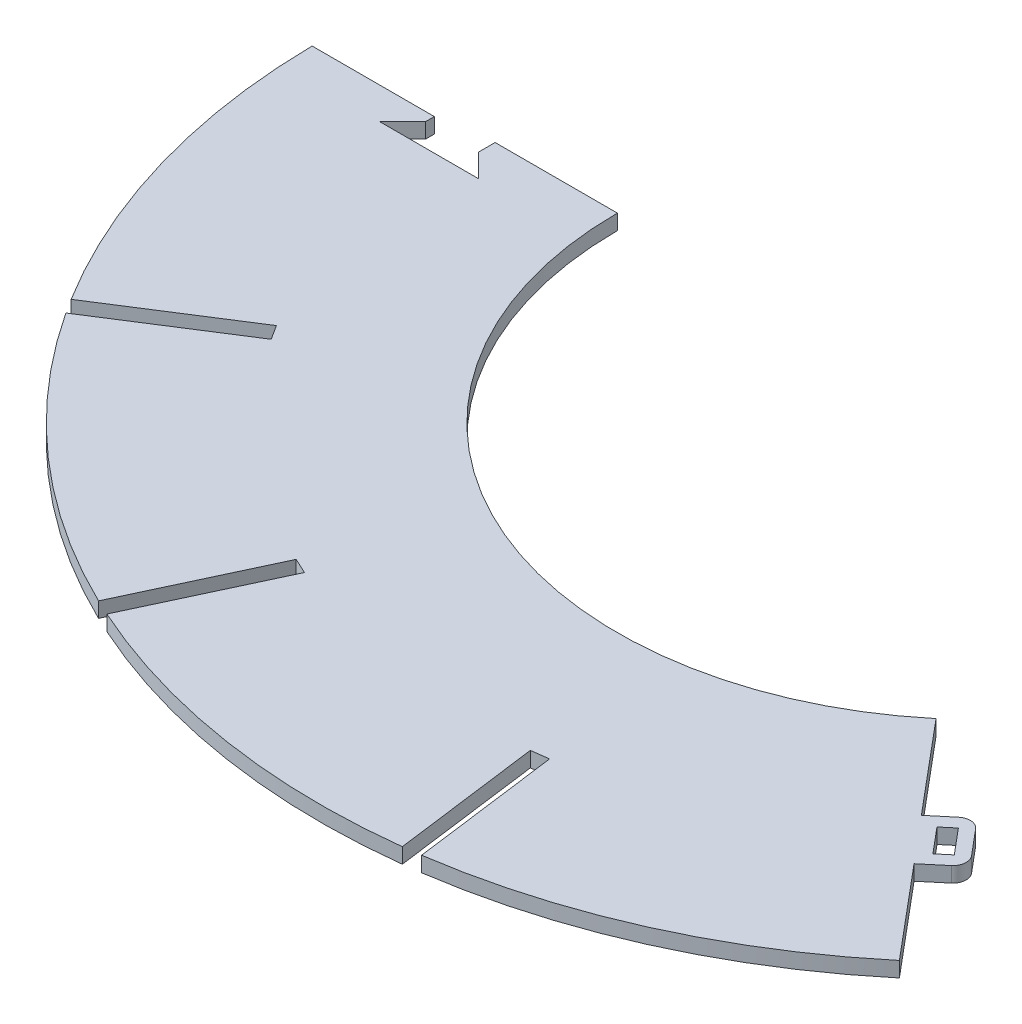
from build123d import *

# Parameters (mm, degrees)
SALIENTE_EXTRUIR1_DEPTH = 23


with BuildPart() as part:
    # Croquis1 → Saliente-Extruir1 (new body)
    with BuildSketch(Plane(origin=(0, 0, 0), x_dir=(1, 0, 0), z_dir=(0, 1, 0))):
        with BuildLine():
            Line((-460.746289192, -481.783080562), (-365.650287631, -277.84904711))
            Line((-365.650287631, -277.84904711), (-342.086285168, -288.837121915))
            Line((-342.086285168, -288.837121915), (-437.182286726, -492.771155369))
            ThreePointArc((-437.182286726, -492.771155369), (-178.505125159, -569.407427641), (91.244640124, -574.103838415))
            Line((91.244640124, -574.103838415), (61.874118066, -351.012574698))
            Line((61.874118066, -351.012574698), (87.651684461, -347.6188937))
            Line((87.651684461, -347.6188937), (117.02220652, -570.710157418))
            ThreePointArc((117.02220652, -570.710157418), (382.306092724, -493.720150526), (616.405870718, -347.090360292))
            Line((616.405870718, -347.090360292), (500.704100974, -209.202360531))
            Line((500.704100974, -209.202360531), (531.345878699, -183.490856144))
            ThreePointArc((531.345878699, -183.490856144), (538.414020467, -169.913082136), (533.811015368, -155.314215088))
            Line((533.811015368, -155.314215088), (501.671634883, -117.011992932))
            ThreePointArc((501.671634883, -117.011992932), (488.093860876, -109.943851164), (473.494993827, -114.546856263))
            Line((473.494993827, -114.546856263), (442.853216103, -140.258360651))
            Line((442.853216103, -140.258360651), (327.151446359, -2.370360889))
            ThreePointArc((327.151446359, -2.370360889), (-258.821782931, -79.515200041), (-576.381738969, 418.954082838))
            Line((-576.381738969, 418.954082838), (-761.381738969, 418.954082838))
            Line((-761.381738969, 418.954082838), (-761.381738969, 393.954082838))
            Line((-761.381738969, 393.954082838), (-726.381738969, 358.954082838))
            Line((-726.381738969, 358.954082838), (-876.381738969, 358.954082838))
            Line((-876.381738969, 358.954082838), (-841.381738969, 393.954082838))
            Line((-841.381738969, 393.954082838), (-841.381738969, 406.95408284))
            Line((-841.381738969, 406.95408284), (-1026.309736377, 406.95408284))
            ThreePointArc((-1026.309736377, 406.95408284), (-986.571398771, 139.60516622), (-876.686810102, -107.33603299))
            Line((-876.686810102, -107.33603299), (-686.909718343, 13.565308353))
            Line((-686.909718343, 13.565308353), (-672.95351148, -8.371522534))
            Line((-672.95351148, -8.371522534), (-862.717020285, -129.264210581))
            ThreePointArc((-862.717020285, -129.264210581), (-685.72755407, -332.885724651), (-460.746289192, -481.783080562))
        make_face()
        Polygon((502.020170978, -181.98990089), (469.880790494, -143.687678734), (487.499812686, -128.903563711), (519.63919317, -167.205785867), align=None, mode=Mode.SUBTRACT)
    extrude(amount=SALIENTE_EXTRUIR1_DEPTH)


solid = part.part
